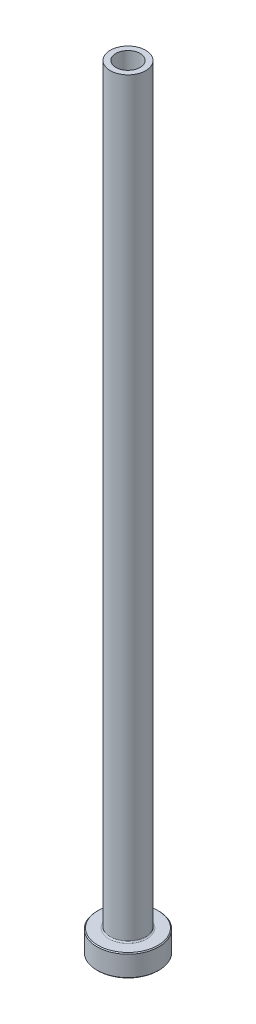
from build123d import *

# Parameters (mm, degrees)
FILLET1_R     = 0.3
CHAMFER1_SIZE = 0.2
CHAMFER3_SIZE = 0.5


with BuildPart() as part:
    # Sketch1 → Revolve1 (revolve)
    with BuildSketch(Plane.XY, mode=Mode.PRIVATE) as revolve1_sk:
        Polygon((-2.75, 175), (-4, 175), (-4, 5), (-7, 5), (-7, 0), (-3, 0), (-3, 118), (-2.75, 130), align=None)
    revolve(revolve1_sk.sketch.rotate(Axis((0, 92.187680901, 0), (0, -1, 0)), 270), axis=Axis((0, 92.187680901, 0), (0, -1, 0)))

    # Fillet1
    fillet1_edges = [part.edges().sort_by_distance(p)[0] for p in [
        (0, 5, -4),
    ]]
    fillet(fillet1_edges, radius=FILLET1_R)

    # Chamfer1
    chamfer1_edges = [part.edges().sort_by_distance(p)[0] for p in [
        (0, 0, -7),
        (0, 5, -7),
    ]]
    chamfer(chamfer1_edges, length=CHAMFER1_SIZE)

    # Chamfer3
    chamfer3_edges = [part.edges().sort_by_distance(p)[0] for p in [
        (0, 0, -3),
    ]]
    chamfer(chamfer3_edges, length=CHAMFER3_SIZE)


solid = part.part
